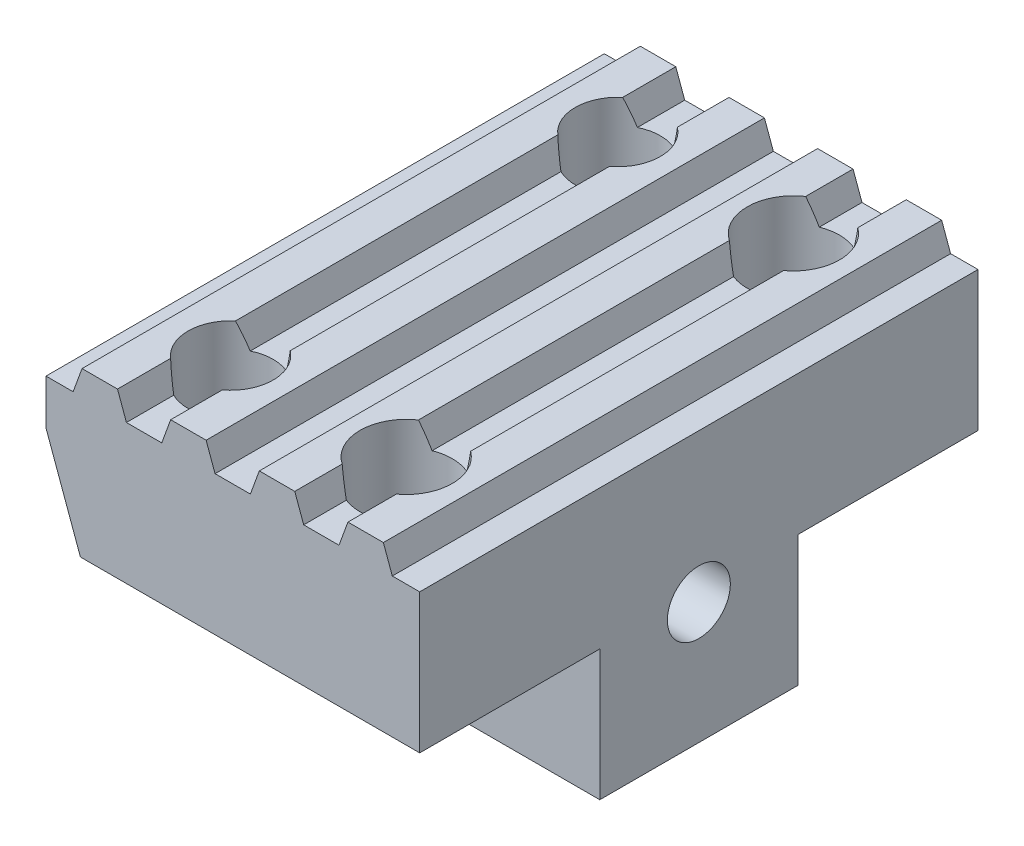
ISO-10303-21;
HEADER;
FILE_DESCRIPTION(('STEP AP214'),'2;1');
FILE_NAME('part.step','',(''),(''),'','','');
FILE_SCHEMA(('AUTOMOTIVE_DESIGN { 1 0 10303 214 1 1 1 1 }'));
ENDSEC;
DATA;
#1=APPLICATION_CONTEXT('core data for automotive mechanical design processes');
#2=APPLICATION_PROTOCOL_DEFINITION('international standard','automotive_design',2000,#1);
#3=PRODUCT_CONTEXT('',#1,'mechanical');
#4=PRODUCT('Part','Part','',(#3));
#5=PRODUCT_RELATED_PRODUCT_CATEGORY('part','',(#4));
#6=PRODUCT_DEFINITION_FORMATION('','',#4);
#7=PRODUCT_DEFINITION_CONTEXT('part definition',#1,'design');
#8=PRODUCT_DEFINITION('design','',#6,#7);
#9=PRODUCT_DEFINITION_SHAPE('','',#8);
#10=(LENGTH_UNIT() NAMED_UNIT(*) SI_UNIT(.MILLI.,.METRE.));
#11=(NAMED_UNIT(*) PLANE_ANGLE_UNIT() SI_UNIT($,.RADIAN.));
#12=(NAMED_UNIT(*) SI_UNIT($,.STERADIAN.) SOLID_ANGLE_UNIT());
#13=UNCERTAINTY_MEASURE_WITH_UNIT(LENGTH_MEASURE(1.E-05),#10,'distance_accuracy_value','');
#14=(GEOMETRIC_REPRESENTATION_CONTEXT(3) GLOBAL_UNCERTAINTY_ASSIGNED_CONTEXT((#13)) GLOBAL_UNIT_ASSIGNED_CONTEXT((#10,
#11,#12)) REPRESENTATION_CONTEXT('',''));
#15=CARTESIAN_POINT('',(0.,0.,0.));
#16=DIRECTION('',(0.,0.,1.));
#17=DIRECTION('',(1.,0.,0.));
#18=AXIS2_PLACEMENT_3D('',#15,#16,#17);
#19=CARTESIAN_POINT('',(7.0167368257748,0.691967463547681,15.748));
#20=DIRECTION('',(-0.939692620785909,-0.342020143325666,0.));
#21=DIRECTION('',(0.342020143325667,-0.939692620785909,0.));
#22=AXIS2_PLACEMENT_3D('',#19,#20,#21);
#23=PLANE('',#22);
#24=DIRECTION('',(0.,0.,0.999999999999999));
#25=VECTOR('',#24,1.);
#26=CARTESIAN_POINT('',(7.26859238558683,0.,15.748));
#27=LINE('',#26,#25);
#28=CARTESIAN_POINT('',(7.26859238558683,0.,14.543770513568));
#29=VERTEX_POINT('',#28);
#30=CARTESIAN_POINT('',(7.26859238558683,0.,15.748));
#31=VERTEX_POINT('',#30);
#32=EDGE_CURVE('E370',#29,#31,#27,.T.);
#33=ORIENTED_EDGE('',*,*,#32,.F.);
#34=CARTESIAN_POINT('',(7.747,-1.31441411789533,13.335));
#35=DIRECTION('',(-0.939692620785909,-0.342020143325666,0.));
#36=DIRECTION('',(0.342020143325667,-0.939692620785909,0.));
#37=AXIS2_PLACEMENT_3D('',#34,#35,#36);
#38=ELLIPSE('',#37,3.80094572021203,1.3);
#39=CARTESIAN_POINT('',(7.0167368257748,0.691967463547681,14.4105071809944));
#40=VERTEX_POINT('',#39);
#41=EDGE_CURVE('E322',#29,#40,#38,.T.);
#42=ORIENTED_EDGE('',*,*,#41,.T.);
#43=DIRECTION('',(0.,0.,-0.999999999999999));
#44=VECTOR('',#43,1.);
#45=CARTESIAN_POINT('',(7.0167368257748,0.691967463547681,15.748));
#46=LINE('',#45,#44);
#47=CARTESIAN_POINT('',(7.0167368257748,0.691967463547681,15.748));
#48=VERTEX_POINT('',#47);
#49=EDGE_CURVE('E363',#48,#40,#46,.T.);
#50=ORIENTED_EDGE('',*,*,#49,.F.);
#51=DIRECTION('',(-0.342020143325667,0.939692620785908,0.));
#52=VECTOR('',#51,1.);
#53=CARTESIAN_POINT('',(7.0167368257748,0.691967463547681,15.748));
#54=LINE('',#53,#52);
#55=EDGE_CURVE('E352',#31,#48,#54,.T.);
#56=ORIENTED_EDGE('',*,*,#55,.F.);
#57=EDGE_LOOP('',(#33,#42,#50,#56));
#58=FACE_BOUND('',#57,.T.);
#59=ADVANCED_FACE('F34',(#58),#23,.F.);
#60=CARTESIAN_POINT('',(0.,0.,15.748));
#61=DIRECTION('',(0.,0.999999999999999,0.));
#62=DIRECTION('',(0.,0.,0.999999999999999));
#63=AXIS2_PLACEMENT_3D('',#60,#61,#62);
#64=PLANE('',#63);
#65=CARTESIAN_POINT('',(7.747,0.,13.335));
#66=DIRECTION('',(0.,0.999999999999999,0.));
#67=DIRECTION('',(0.,0.,0.999999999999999));
#68=AXIS2_PLACEMENT_3D('',#65,#66,#67);
#69=CIRCLE('',#68,1.3);
#70=CARTESIAN_POINT('',(8.26488126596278,0.,12.1426078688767));
#71=VERTEX_POINT('',#70);
#72=CARTESIAN_POINT('',(7.26859238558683,0.,12.126229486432));
#73=VERTEX_POINT('',#72);
#74=EDGE_CURVE('E321',#71,#73,#69,.T.);
#75=ORIENTED_EDGE('',*,*,#74,.F.);
#76=DIRECTION('',(0.,0.,-0.999999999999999));
#77=VECTOR('',#76,1.);
#78=CARTESIAN_POINT('',(8.26488126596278,0.,15.748));
#79=LINE('',#78,#77);
#80=CARTESIAN_POINT('',(8.26488126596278,0.,3.60539213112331));
#81=VERTEX_POINT('',#80);
#82=EDGE_CURVE('E320',#71,#81,#79,.T.);
#83=ORIENTED_EDGE('',*,*,#82,.T.);
#84=CARTESIAN_POINT('',(7.747,0.,2.413));
#85=DIRECTION('',(0.,0.999999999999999,0.));
#86=DIRECTION('',(0.,0.,0.999999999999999));
#87=AXIS2_PLACEMENT_3D('',#84,#85,#86);
#88=CIRCLE('',#87,1.3);
#89=CARTESIAN_POINT('',(7.26859238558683,0.,3.62177051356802));
#90=VERTEX_POINT('',#89);
#91=EDGE_CURVE('E615',#90,#81,#88,.T.);
#92=ORIENTED_EDGE('',*,*,#91,.F.);
#93=EDGE_CURVE('E375',#90,#73,#27,.T.);
#94=ORIENTED_EDGE('',*,*,#93,.T.);
#95=EDGE_LOOP('',(#75,#83,#92,#94));
#96=FACE_BOUND('',#95,.T.);
#97=ADVANCED_FACE('F660',(#96),#64,.T.);
#98=CARTESIAN_POINT('',(8.26195766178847,-0.00803253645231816,15.748));
#99=DIRECTION('',(0.93969262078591,-0.342020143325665,0.));
#100=DIRECTION('',(0.342020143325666,0.939692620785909,0.));
#101=AXIS2_PLACEMENT_3D('',#98,#99,#100);
#102=PLANE('',#101);
#103=ORIENTED_EDGE('',*,*,#82,.F.);
#104=CARTESIAN_POINT('',(7.747,-1.42286708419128,13.335));
#105=DIRECTION('',(0.93969262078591,-0.342020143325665,0.));
#106=DIRECTION('',(-0.342020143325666,-0.939692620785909,0.));
#107=AXIS2_PLACEMENT_3D('',#104,#105,#106);
#108=ELLIPSE('',#107,3.80094572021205,1.3);
#109=CARTESIAN_POINT('',(8.51673682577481,0.691967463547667,12.2873811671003));
#110=VERTEX_POINT('',#109);
#111=EDGE_CURVE('E303',#71,#110,#108,.T.);
#112=ORIENTED_EDGE('',*,*,#111,.T.);
#113=DIRECTION('',(0.,0.,-0.999999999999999));
#114=VECTOR('',#113,1.);
#115=CARTESIAN_POINT('',(8.51673682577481,0.691967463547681,15.748));
#116=LINE('',#115,#114);
#117=CARTESIAN_POINT('',(8.51673682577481,0.691967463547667,3.4606188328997));
#118=VERTEX_POINT('',#117);
#119=EDGE_CURVE('E318',#110,#118,#116,.T.);
#120=ORIENTED_EDGE('',*,*,#119,.T.);
#121=CARTESIAN_POINT('',(7.747,-1.42286708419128,2.413));
#122=DIRECTION('',(0.93969262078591,-0.342020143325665,0.));
#123=DIRECTION('',(-0.342020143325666,-0.939692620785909,0.));
#124=AXIS2_PLACEMENT_3D('',#121,#122,#123);
#125=ELLIPSE('',#124,3.80094572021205,1.3);
#126=EDGE_CURVE('E612',#118,#81,#125,.T.);
#127=ORIENTED_EDGE('',*,*,#126,.T.);
#128=EDGE_LOOP('',(#103,#112,#120,#127));
#129=FACE_BOUND('',#128,.T.);
#130=ADVANCED_FACE('F316',(#129),#102,.F.);
#131=CARTESIAN_POINT('',(8.26488126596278,0.,1.22060786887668));
#132=VERTEX_POINT('',#131);
#133=CARTESIAN_POINT('',(7.26859238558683,0.,1.20422948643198));
#134=VERTEX_POINT('',#133);
#135=EDGE_CURVE('E609',#132,#134,#88,.T.);
#136=ORIENTED_EDGE('',*,*,#135,.F.);
#137=CARTESIAN_POINT('',(8.26488126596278,0.,0.));
#138=VERTEX_POINT('',#137);
#139=EDGE_CURVE('E338',#132,#138,#79,.T.);
#140=ORIENTED_EDGE('',*,*,#139,.T.);
#141=DIRECTION('',(-1.,0.,0.));
#142=VECTOR('',#141,1.);
#143=CARTESIAN_POINT('',(0.,0.,0.));
#144=LINE('',#143,#142);
#145=CARTESIAN_POINT('',(7.26859238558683,0.,0.));
#146=VERTEX_POINT('',#145);
#147=EDGE_CURVE('E412',#138,#146,#144,.T.);
#148=ORIENTED_EDGE('',*,*,#147,.T.);
#149=EDGE_CURVE('E371',#146,#134,#27,.T.);
#150=ORIENTED_EDGE('',*,*,#149,.T.);
#151=EDGE_LOOP('',(#136,#140,#148,#150));
#152=FACE_BOUND('',#151,.T.);
#153=ADVANCED_FACE('F670',(#152),#64,.T.);
#154=CARTESIAN_POINT('',(7.0167368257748,0.691967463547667,12.2594928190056));
#155=VERTEX_POINT('',#154);
#156=CARTESIAN_POINT('',(7.0167368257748,0.691967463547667,3.4885071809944));
#157=VERTEX_POINT('',#156);
#158=EDGE_CURVE('E367',#155,#157,#46,.T.);
#159=ORIENTED_EDGE('',*,*,#158,.F.);
#160=EDGE_CURVE('E629',#155,#73,#38,.T.);
#161=ORIENTED_EDGE('',*,*,#160,.T.);
#162=ORIENTED_EDGE('',*,*,#93,.F.);
#163=CARTESIAN_POINT('',(7.747,-1.31441411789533,2.413));
#164=DIRECTION('',(-0.939692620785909,-0.342020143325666,0.));
#165=DIRECTION('',(0.342020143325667,-0.939692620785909,0.));
#166=AXIS2_PLACEMENT_3D('',#163,#164,#165);
#167=ELLIPSE('',#166,3.80094572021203,1.3);
#168=EDGE_CURVE('E610',#90,#157,#167,.T.);
#169=ORIENTED_EDGE('',*,*,#168,.T.);
#170=EDGE_LOOP('',(#159,#161,#162,#169));
#171=FACE_BOUND('',#170,.T.);
#172=ADVANCED_FACE('F663',(#171),#23,.F.);
#173=ORIENTED_EDGE('',*,*,#139,.F.);
#174=CARTESIAN_POINT('',(8.51673682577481,0.691967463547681,1.3653811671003));
#175=VERTEX_POINT('',#174);
#176=EDGE_CURVE('E606',#132,#175,#125,.T.);
#177=ORIENTED_EDGE('',*,*,#176,.T.);
#178=CARTESIAN_POINT('',(8.51673682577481,0.691967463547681,0.));
#179=VERTEX_POINT('',#178);
#180=EDGE_CURVE('E329',#175,#179,#116,.T.);
#181=ORIENTED_EDGE('',*,*,#180,.T.);
#182=DIRECTION('',(-0.342020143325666,-0.939692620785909,0.));
#183=VECTOR('',#182,1.);
#184=CARTESIAN_POINT('',(8.26195766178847,-0.00803253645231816,0.));
#185=LINE('',#184,#183);
#186=EDGE_CURVE('E552',#179,#138,#185,.T.);
#187=ORIENTED_EDGE('',*,*,#186,.T.);
#188=EDGE_LOOP('',(#173,#177,#181,#187));
#189=FACE_BOUND('',#188,.T.);
#190=ADVANCED_FACE('F604',(#189),#102,.F.);
#191=CARTESIAN_POINT('',(0.761957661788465,-0.00803253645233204,0.));
#192=DIRECTION('',(0.,0.,0.999999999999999));
#193=DIRECTION('',(1.,0.,0.));
#194=AXIS2_PLACEMENT_3D('',#191,#192,#193);
#195=PLANE('',#194);
#196=DIRECTION('',(1.,0.,0.));
#197=VECTOR('',#196,1.);
#198=CARTESIAN_POINT('',(0.,-3.93485799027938,0.));
#199=LINE('',#198,#197);
#200=CARTESIAN_POINT('',(0.969928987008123,-3.93485799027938,0.));
#201=VERTEX_POINT('',#200);
#202=CARTESIAN_POINT('',(10.541,-3.93485799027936,0.));
#203=VERTEX_POINT('',#202);
#204=EDGE_CURVE('E492',#201,#203,#199,.T.);
#205=ORIENTED_EDGE('',*,*,#204,.F.);
#206=DIRECTION('',(0.342020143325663,-0.93969262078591,0.));
#207=VECTOR('',#206,1.);
#208=CARTESIAN_POINT('',(0.,-1.27,0.));
#209=LINE('',#208,#207);
#210=CARTESIAN_POINT('',(0.,-1.27,0.));
#211=VERTEX_POINT('',#210);
#212=EDGE_CURVE('E539',#211,#201,#209,.T.);
#213=ORIENTED_EDGE('',*,*,#212,.F.);
#214=DIRECTION('',(0.,0.999999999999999,0.));
#215=VECTOR('',#214,1.);
#216=CARTESIAN_POINT('',(0.,-7.62,0.));
#217=LINE('',#216,#215);
#218=CARTESIAN_POINT('',(0.,0.,0.));
#219=VERTEX_POINT('',#218);
#220=EDGE_CURVE('E416',#211,#219,#217,.T.);
#221=ORIENTED_EDGE('',*,*,#220,.T.);
#222=CARTESIAN_POINT('',(0.764881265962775,0.,0.));
#223=VERTEX_POINT('',#222);
#224=EDGE_CURVE('E408',#223,#219,#144,.T.);
#225=ORIENTED_EDGE('',*,*,#224,.F.);
#226=DIRECTION('',(-0.342020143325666,-0.939692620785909,0.));
#227=VECTOR('',#226,1.);
#228=CARTESIAN_POINT('',(0.761957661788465,-0.00803253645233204,0.));
#229=LINE('',#228,#227);
#230=CARTESIAN_POINT('',(1.0167368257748,0.691967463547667,0.));
#231=VERTEX_POINT('',#230);
#232=EDGE_CURVE('E436',#231,#223,#229,.T.);
#233=ORIENTED_EDGE('',*,*,#232,.F.);
#234=DIRECTION('',(-1.,0.,0.));
#235=VECTOR('',#234,1.);
#236=CARTESIAN_POINT('',(1.0167368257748,0.691967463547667,0.));
#237=LINE('',#236,#235);
#238=CARTESIAN_POINT('',(2.0167368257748,0.691967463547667,0.));
#239=VERTEX_POINT('',#238);
#240=EDGE_CURVE('E434',#239,#231,#237,.T.);
#241=ORIENTED_EDGE('',*,*,#240,.F.);
#242=DIRECTION('',(-0.342020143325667,0.939692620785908,0.));
#243=VECTOR('',#242,1.);
#244=CARTESIAN_POINT('',(2.0167368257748,0.691967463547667,0.));
#245=LINE('',#244,#243);
#246=CARTESIAN_POINT('',(2.26859238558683,0.,0.));
#247=VERTEX_POINT('',#246);
#248=EDGE_CURVE('E430',#247,#239,#245,.T.);
#249=ORIENTED_EDGE('',*,*,#248,.F.);
#250=CARTESIAN_POINT('',(3.26488126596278,0.,0.));
#251=VERTEX_POINT('',#250);
#252=EDGE_CURVE('E750',#251,#247,#144,.T.);
#253=ORIENTED_EDGE('',*,*,#252,.F.);
#254=DIRECTION('',(-0.342020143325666,-0.939692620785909,0.));
#255=VECTOR('',#254,1.);
#256=CARTESIAN_POINT('',(3.26195766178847,-0.00803253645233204,0.));
#257=LINE('',#256,#255);
#258=CARTESIAN_POINT('',(3.5167368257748,0.691967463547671,0.));
#259=VERTEX_POINT('',#258);
#260=EDGE_CURVE('E380',#259,#251,#257,.T.);
#261=ORIENTED_EDGE('',*,*,#260,.F.);
#262=DIRECTION('',(-1.,0.,0.));
#263=VECTOR('',#262,1.);
#264=CARTESIAN_POINT('',(3.5167368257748,0.691967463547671,0.));
#265=LINE('',#264,#263);
#266=CARTESIAN_POINT('',(4.5167368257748,0.691967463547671,0.));
#267=VERTEX_POINT('',#266);
#268=EDGE_CURVE('E377',#267,#259,#265,.T.);
#269=ORIENTED_EDGE('',*,*,#268,.F.);
#270=DIRECTION('',(-0.342020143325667,0.939692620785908,0.));
#271=VECTOR('',#270,1.);
#272=CARTESIAN_POINT('',(4.5167368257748,0.691967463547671,0.));
#273=LINE('',#272,#271);
#274=CARTESIAN_POINT('',(4.76859238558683,0.,0.));
#275=VERTEX_POINT('',#274);
#276=EDGE_CURVE('E374',#275,#267,#273,.T.);
#277=ORIENTED_EDGE('',*,*,#276,.F.);
#278=CARTESIAN_POINT('',(5.76488126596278,0.,0.));
#279=VERTEX_POINT('',#278);
#280=EDGE_CURVE('E752',#279,#275,#144,.T.);
#281=ORIENTED_EDGE('',*,*,#280,.F.);
#282=DIRECTION('',(-0.342020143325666,-0.939692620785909,0.));
#283=VECTOR('',#282,1.);
#284=CARTESIAN_POINT('',(5.76195766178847,-0.00803253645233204,0.));
#285=LINE('',#284,#283);
#286=CARTESIAN_POINT('',(6.0167368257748,0.691967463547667,0.));
#287=VERTEX_POINT('',#286);
#288=EDGE_CURVE('E349',#287,#279,#285,.T.);
#289=ORIENTED_EDGE('',*,*,#288,.F.);
#290=DIRECTION('',(-1.,0.,0.));
#291=VECTOR('',#290,1.);
#292=CARTESIAN_POINT('',(6.0167368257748,0.691967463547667,0.));
#293=LINE('',#292,#291);
#294=CARTESIAN_POINT('',(7.0167368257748,0.691967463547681,0.));
#295=VERTEX_POINT('',#294);
#296=EDGE_CURVE('E347',#295,#287,#293,.T.);
#297=ORIENTED_EDGE('',*,*,#296,.F.);
#298=DIRECTION('',(-0.342020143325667,0.939692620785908,0.));
#299=VECTOR('',#298,1.);
#300=CARTESIAN_POINT('',(7.0167368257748,0.691967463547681,0.));
#301=LINE('',#300,#299);
#302=EDGE_CURVE('E344',#146,#295,#301,.T.);
#303=ORIENTED_EDGE('',*,*,#302,.F.);
#304=ORIENTED_EDGE('',*,*,#147,.F.);
#305=ORIENTED_EDGE('',*,*,#186,.F.);
#306=DIRECTION('',(-1.,0.,0.));
#307=VECTOR('',#306,1.);
#308=CARTESIAN_POINT('',(8.51673682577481,0.691967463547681,0.));
#309=LINE('',#308,#307);
#310=CARTESIAN_POINT('',(9.51673682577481,0.691967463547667,0.));
#311=VERTEX_POINT('',#310);
#312=EDGE_CURVE('E549',#311,#179,#309,.T.);
#313=ORIENTED_EDGE('',*,*,#312,.F.);
#314=DIRECTION('',(-0.342020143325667,0.939692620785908,0.));
#315=VECTOR('',#314,1.);
#316=CARTESIAN_POINT('',(9.51673682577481,0.691967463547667,0.));
#317=LINE('',#316,#315);
#318=CARTESIAN_POINT('',(9.76859238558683,0.,0.));
#319=VERTEX_POINT('',#318);
#320=EDGE_CURVE('E547',#319,#311,#317,.T.);
#321=ORIENTED_EDGE('',*,*,#320,.F.);
#322=CARTESIAN_POINT('',(10.541,0.,0.));
#323=VERTEX_POINT('',#322);
#324=EDGE_CURVE('E409',#323,#319,#144,.T.);
#325=ORIENTED_EDGE('',*,*,#324,.F.);
#326=DIRECTION('',(0.,0.999999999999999,0.));
#327=VECTOR('',#326,1.);
#328=CARTESIAN_POINT('',(10.541,-7.61999999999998,0.));
#329=LINE('',#328,#327);
#330=EDGE_CURVE('E419',#203,#323,#329,.T.);
#331=ORIENTED_EDGE('',*,*,#330,.F.);
#332=EDGE_LOOP('',(#205,#213,#221,#225,#233,#241,#249,#253,#261,#269,#277,#281,#289,#297,#303,
#304,#305,#313,#321,#325,#331));
#333=FACE_BOUND('',#332,.T.);
#334=ADVANCED_FACE('F592',(#333),#195,.F.);
#335=CARTESIAN_POINT('',(10.541,-7.61999999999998,0.));
#336=DIRECTION('',(1.,0.,0.));
#337=DIRECTION('',(0.,0.,-0.999999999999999));
#338=AXIS2_PLACEMENT_3D('',#335,#336,#337);
#339=PLANE('',#338);
#340=CARTESIAN_POINT('',(10.541,-4.18885799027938,7.87400000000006));
#341=DIRECTION('',(1.,0.,0.));
#342=DIRECTION('',(0.,0.,-0.999999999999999));
#343=AXIS2_PLACEMENT_3D('',#340,#341,#342);
#344=CIRCLE('',#343,0.888999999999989);
#345=CARTESIAN_POINT('',(10.541,-4.18885799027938,6.98500000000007));
#346=VERTEX_POINT('',#345);
#347=EDGE_CURVE('E633',#346,#346,#344,.T.);
#348=ORIENTED_EDGE('',*,*,#347,.F.);
#349=EDGE_LOOP('',(#348));
#350=FACE_BOUND('',#349,.T.);
#351=DIRECTION('',(0.,0.,-0.999999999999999));
#352=VECTOR('',#351,1.);
#353=CARTESIAN_POINT('',(10.541,-7.61999999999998,0.));
#354=LINE('',#353,#352);
#355=CARTESIAN_POINT('',(10.541,-7.61999999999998,10.668));
#356=VERTEX_POINT('',#355);
#357=CARTESIAN_POINT('',(10.541,-7.61999999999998,5.08));
#358=VERTEX_POINT('',#357);
#359=EDGE_CURVE('E411',#356,#358,#354,.T.);
#360=ORIENTED_EDGE('',*,*,#359,.T.);
#361=DIRECTION('',(0.,0.999999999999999,0.));
#362=VECTOR('',#361,1.);
#363=CARTESIAN_POINT('',(10.541,-3.93485799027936,5.07999999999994));
#364=LINE('',#363,#362);
#365=CARTESIAN_POINT('',(10.541,-3.93485799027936,5.07999999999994));
#366=VERTEX_POINT('',#365);
#367=EDGE_CURVE('E489',#358,#366,#364,.T.);
#368=ORIENTED_EDGE('',*,*,#367,.T.);
#369=DIRECTION('',(0.,0.,-0.999999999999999));
#370=VECTOR('',#369,1.);
#371=CARTESIAN_POINT('',(10.541,-3.93485799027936,0.));
#372=LINE('',#371,#370);
#373=EDGE_CURVE('E589',#366,#203,#372,.T.);
#374=ORIENTED_EDGE('',*,*,#373,.T.);
#375=ORIENTED_EDGE('',*,*,#330,.T.);
#376=DIRECTION('',(0.,0.,-0.999999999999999));
#377=VECTOR('',#376,1.);
#378=CARTESIAN_POINT('',(10.541,0.,0.));
#379=LINE('',#378,#377);
#380=CARTESIAN_POINT('',(10.541,0.,15.748));
#381=VERTEX_POINT('',#380);
#382=EDGE_CURVE('E404',#381,#323,#379,.T.);
#383=ORIENTED_EDGE('',*,*,#382,.F.);
#384=DIRECTION('',(0.,0.999999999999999,0.));
#385=VECTOR('',#384,1.);
#386=CARTESIAN_POINT('',(10.541,-7.61999999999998,15.748));
#387=LINE('',#386,#385);
#388=CARTESIAN_POINT('',(10.541,-3.93485799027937,15.748));
#389=VERTEX_POINT('',#388);
#390=EDGE_CURVE('E421',#389,#381,#387,.T.);
#391=ORIENTED_EDGE('',*,*,#390,.F.);
#392=DIRECTION('',(0.,0.,0.999999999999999));
#393=VECTOR('',#392,1.);
#394=CARTESIAN_POINT('',(10.541,-3.93485799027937,15.748));
#395=LINE('',#394,#393);
#396=CARTESIAN_POINT('',(10.541,-3.93485799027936,10.6680000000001));
#397=VERTEX_POINT('',#396);
#398=EDGE_CURVE('E502',#397,#389,#395,.T.);
#399=ORIENTED_EDGE('',*,*,#398,.F.);
#400=DIRECTION('',(0.,0.999999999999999,0.));
#401=VECTOR('',#400,1.);
#402=CARTESIAN_POINT('',(10.541,-3.93485799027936,10.6680000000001));
#403=LINE('',#402,#401);
#404=EDGE_CURVE('E499',#356,#397,#403,.T.);
#405=ORIENTED_EDGE('',*,*,#404,.F.);
#406=EDGE_LOOP('',(#360,#368,#374,#375,#383,#391,#399,#405));
#407=FACE_BOUND('',#406,.T.);
#408=ADVANCED_FACE('F584',(#350,#407),#339,.T.);
#409=CARTESIAN_POINT('',(0.,-7.61999999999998,15.748));
#410=DIRECTION('',(0.,0.999999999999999,0.));
#411=DIRECTION('',(0.,0.,0.999999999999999));
#412=AXIS2_PLACEMENT_3D('',#409,#410,#411);
#413=PLANE('',#412);
#414=DIRECTION('',(1.,0.,0.));
#415=VECTOR('',#414,1.);
#416=CARTESIAN_POINT('',(0.,-7.61999999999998,10.668));
#417=LINE('',#416,#415);
#418=CARTESIAN_POINT('',(3.20047456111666,-7.61999999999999,10.668));
#419=VERTEX_POINT('',#418);
#420=EDGE_CURVE('E484',#419,#356,#417,.T.);
#421=ORIENTED_EDGE('',*,*,#420,.F.);
#422=DIRECTION('',(0.,0.,-0.999999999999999));
#423=VECTOR('',#422,1.);
#424=CARTESIAN_POINT('',(3.20047456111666,-7.62,15.748));
#425=LINE('',#424,#423);
#426=CARTESIAN_POINT('',(3.20047456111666,-7.62,5.07999999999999));
#427=VERTEX_POINT('',#426);
#428=EDGE_CURVE('E475',#419,#427,#425,.T.);
#429=ORIENTED_EDGE('',*,*,#428,.T.);
#430=DIRECTION('',(1.,0.,0.));
#431=VECTOR('',#430,1.);
#432=CARTESIAN_POINT('',(0.,-7.62,5.07999999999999));
#433=LINE('',#432,#431);
#434=EDGE_CURVE('E473',#427,#358,#433,.T.);
#435=ORIENTED_EDGE('',*,*,#434,.T.);
#436=ORIENTED_EDGE('',*,*,#359,.F.);
#437=EDGE_LOOP('',(#421,#429,#435,#436));
#438=FACE_BOUND('',#437,.T.);
#439=ADVANCED_FACE('F481',(#438),#413,.F.);
#440=CARTESIAN_POINT('',(0.,-1.26999999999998,15.748));
#441=DIRECTION('',(0.939692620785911,0.342020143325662,0.));
#442=DIRECTION('',(-0.342020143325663,0.93969262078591,0.));
#443=AXIS2_PLACEMENT_3D('',#440,#441,#442);
#444=PLANE('',#443);
#445=DIRECTION('',(-0.342020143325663,0.93969262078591,0.));
#446=VECTOR('',#445,1.);
#447=CARTESIAN_POINT('',(0.,-1.27000000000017,5.07999999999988));
#448=LINE('',#447,#446);
#449=CARTESIAN_POINT('',(2.00706493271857,-6.78436558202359,5.07999999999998));
#450=VERTEX_POINT('',#449);
#451=CARTESIAN_POINT('',(0.969928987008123,-3.93485799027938,5.07999999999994));
#452=VERTEX_POINT('',#451);
#453=EDGE_CURVE('E468',#450,#452,#448,.T.);
#454=ORIENTED_EDGE('',*,*,#453,.F.);
#455=DIRECTION('',(0.,0.,-0.999999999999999));
#456=VECTOR('',#455,1.);
#457=CARTESIAN_POINT('',(2.00706493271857,-6.78436558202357,15.748));
#458=LINE('',#457,#456);
#459=CARTESIAN_POINT('',(2.00706493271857,-6.78436558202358,10.668));
#460=VERTEX_POINT('',#459);
#461=EDGE_CURVE('E42',#450,#460,#458,.F.);
#462=ORIENTED_EDGE('',*,*,#461,.T.);
#463=DIRECTION('',(-0.342020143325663,0.93969262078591,0.));
#464=VECTOR('',#463,1.);
#465=CARTESIAN_POINT('',(0.,-1.26999999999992,10.6680000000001));
#466=LINE('',#465,#464);
#467=CARTESIAN_POINT('',(0.969928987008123,-3.93485799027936,10.6680000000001));
#468=VERTEX_POINT('',#467);
#469=EDGE_CURVE('E461',#460,#468,#466,.T.);
#470=ORIENTED_EDGE('',*,*,#469,.T.);
#471=DIRECTION('',(0.,0.,0.999999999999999));
#472=VECTOR('',#471,1.);
#473=CARTESIAN_POINT('',(0.969928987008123,-3.93485799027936,15.748));
#474=LINE('',#473,#472);
#475=CARTESIAN_POINT('',(0.969928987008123,-3.93485799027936,15.748));
#476=VERTEX_POINT('',#475);
#477=EDGE_CURVE('E465',#468,#476,#474,.T.);
#478=ORIENTED_EDGE('',*,*,#477,.T.);
#479=DIRECTION('',(0.342020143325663,-0.93969262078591,0.));
#480=VECTOR('',#479,1.);
#481=CARTESIAN_POINT('',(0.,-1.26999999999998,15.748));
#482=LINE('',#481,#480);
#483=CARTESIAN_POINT('',(0.,-1.26999999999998,15.748));
#484=VERTEX_POINT('',#483);
#485=EDGE_CURVE('E542',#484,#476,#482,.T.);
#486=ORIENTED_EDGE('',*,*,#485,.F.);
#487=DIRECTION('',(0.,0.,-0.999999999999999));
#488=VECTOR('',#487,1.);
#489=CARTESIAN_POINT('',(0.,-1.26999999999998,15.748));
#490=LINE('',#489,#488);
#491=EDGE_CURVE('E545',#484,#211,#490,.T.);
#492=ORIENTED_EDGE('',*,*,#491,.T.);
#493=ORIENTED_EDGE('',*,*,#212,.T.);
#494=DIRECTION('',(0.,0.,-0.999999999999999));
#495=VECTOR('',#494,1.);
#496=CARTESIAN_POINT('',(0.969928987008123,-3.93485799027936,15.748));
#497=LINE('',#496,#495);
#498=EDGE_CURVE('E472',#452,#201,#497,.T.);
#499=ORIENTED_EDGE('',*,*,#498,.F.);
#500=EDGE_LOOP('',(#454,#462,#470,#478,#486,#492,#493,#499));
#501=FACE_BOUND('',#500,.T.);
#502=ADVANCED_FACE('F655',(#501),#444,.F.);
#503=CARTESIAN_POINT('',(2.79399999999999,0.691967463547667,2.413));
#504=DIRECTION('',(0.,0.999999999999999,0.));
#505=DIRECTION('',(0.,0.,0.999999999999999));
#506=AXIS2_PLACEMENT_3D('',#503,#504,#505);
#507=CYLINDRICAL_SURFACE('',#506,1.20015);
#508=CARTESIAN_POINT('',(2.79399999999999,0.,2.413));
#509=DIRECTION('',(0.,0.999999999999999,0.));
#510=DIRECTION('',(0.,0.,0.999999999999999));
#511=AXIS2_PLACEMENT_3D('',#508,#509,#510);
#512=CIRCLE('',#511,1.20015);
#513=CARTESIAN_POINT('',(2.26859238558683,0.,3.49203051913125));
#514=VERTEX_POINT('',#513);
#515=CARTESIAN_POINT('',(3.26488126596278,0.,3.51691614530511));
#516=VERTEX_POINT('',#515);
#517=EDGE_CURVE('E535',#514,#516,#512,.T.);
#518=ORIENTED_EDGE('',*,*,#517,.T.);
#519=CARTESIAN_POINT('',(2.79399999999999,-1.29373564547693,2.413));
#520=DIRECTION('',(0.93969262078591,-0.342020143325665,0.));
#521=DIRECTION('',(0.342020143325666,0.939692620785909,0.));
#522=AXIS2_PLACEMENT_3D('',#519,#520,#521);
#523=ELLIPSE('',#522,3.50900385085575,1.20015);
#524=CARTESIAN_POINT('',(3.5167368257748,0.691967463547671,3.37112916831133));
#525=VERTEX_POINT('',#524);
#526=EDGE_CURVE('E532',#525,#516,#523,.T.);
#527=ORIENTED_EDGE('',*,*,#526,.F.);
#528=CARTESIAN_POINT('',(2.79399999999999,0.691967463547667,2.413));
#529=DIRECTION('',(0.,0.999999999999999,0.));
#530=DIRECTION('',(0.,0.,0.999999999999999));
#531=AXIS2_PLACEMENT_3D('',#528,#529,#530);
#532=CIRCLE('',#531,1.20015);
#533=CARTESIAN_POINT('',(3.5167368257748,0.691967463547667,1.45487083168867));
#534=VERTEX_POINT('',#533);
#535=EDGE_CURVE('E525',#525,#534,#532,.T.);
#536=ORIENTED_EDGE('',*,*,#535,.T.);
#537=CARTESIAN_POINT('',(3.26488126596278,0.,1.30908385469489));
#538=VERTEX_POINT('',#537);
#539=EDGE_CURVE('E527',#538,#534,#523,.T.);
#540=ORIENTED_EDGE('',*,*,#539,.F.);
#541=CARTESIAN_POINT('',(2.26859238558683,0.,1.33396948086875));
#542=VERTEX_POINT('',#541);
#543=EDGE_CURVE('E531',#538,#542,#512,.T.);
#544=ORIENTED_EDGE('',*,*,#543,.T.);
#545=CARTESIAN_POINT('',(2.79399999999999,-1.4435455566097,2.413));
#546=DIRECTION('',(-0.939692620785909,-0.342020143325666,0.));
#547=DIRECTION('',(-0.342020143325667,0.939692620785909,0.));
#548=AXIS2_PLACEMENT_3D('',#545,#546,#547);
#549=ELLIPSE('',#548,3.50900385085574,1.20015);
#550=CARTESIAN_POINT('',(2.0167368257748,0.691967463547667,1.49854826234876));
#551=VERTEX_POINT('',#550);
#552=EDGE_CURVE('E534',#551,#542,#549,.T.);
#553=ORIENTED_EDGE('',*,*,#552,.F.);
#554=CARTESIAN_POINT('',(2.0167368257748,0.691967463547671,3.32745173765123));
#555=VERTEX_POINT('',#554);
#556=EDGE_CURVE('E528',#551,#555,#532,.T.);
#557=ORIENTED_EDGE('',*,*,#556,.T.);
#558=EDGE_CURVE('E538',#514,#555,#549,.T.);
#559=ORIENTED_EDGE('',*,*,#558,.F.);
#560=EDGE_LOOP('',(#518,#527,#536,#540,#544,#553,#557,#559));
#561=FACE_BOUND('',#560,.T.);
#562=CARTESIAN_POINT('',(2.79399999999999,-3.93485799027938,2.41300000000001));
#563=DIRECTION('',(0.,-0.999999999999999,0.));
#564=DIRECTION('',(0.,0.,-0.999999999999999));
#565=AXIS2_PLACEMENT_3D('',#562,#563,#564);
#566=CIRCLE('',#565,1.20015);
#567=CARTESIAN_POINT('',(2.79399999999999,-3.93485799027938,1.21285000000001));
#568=VERTEX_POINT('',#567);
#569=EDGE_CURVE('E469',#568,#568,#566,.F.);
#570=ORIENTED_EDGE('',*,*,#569,.F.);
#571=EDGE_LOOP('',(#570));
#572=FACE_BOUND('',#571,.T.);
#573=ADVANCED_FACE('F768',(#561,#572),#507,.F.);
#574=CARTESIAN_POINT('',(3.26195766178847,-0.00803253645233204,15.748));
#575=DIRECTION('',(0.93969262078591,-0.342020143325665,0.));
#576=DIRECTION('',(0.342020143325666,0.939692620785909,0.));
#577=AXIS2_PLACEMENT_3D('',#574,#575,#576);
#578=PLANE('',#577);
#579=DIRECTION('',(0.,0.,-0.999999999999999));
#580=VECTOR('',#579,1.);
#581=CARTESIAN_POINT('',(3.5167368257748,0.691967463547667,15.748));
#582=LINE('',#581,#580);
#583=CARTESIAN_POINT('',(3.5167368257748,0.691967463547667,15.748));
#584=VERTEX_POINT('',#583);
#585=CARTESIAN_POINT('',(3.5167368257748,0.691967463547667,14.2931291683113));
#586=VERTEX_POINT('',#585);
#587=EDGE_CURVE('E391',#584,#586,#582,.T.);
#588=ORIENTED_EDGE('',*,*,#587,.T.);
#589=CARTESIAN_POINT('',(2.79399999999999,-1.29373564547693,13.335));
#590=DIRECTION('',(0.93969262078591,-0.342020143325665,0.));
#591=DIRECTION('',(0.342020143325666,0.939692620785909,0.));
#592=AXIS2_PLACEMENT_3D('',#589,#590,#591);
#593=ELLIPSE('',#592,3.50900385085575,1.20015);
#594=CARTESIAN_POINT('',(3.26488126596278,0.,14.4389161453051));
#595=VERTEX_POINT('',#594);
#596=EDGE_CURVE('E520',#586,#595,#593,.T.);
#597=ORIENTED_EDGE('',*,*,#596,.T.);
#598=DIRECTION('',(0.,0.,-0.999999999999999));
#599=VECTOR('',#598,1.);
#600=CARTESIAN_POINT('',(3.26488126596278,0.,15.748));
#601=LINE('',#600,#599);
#602=CARTESIAN_POINT('',(3.26488126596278,0.,15.748));
#603=VERTEX_POINT('',#602);
#604=EDGE_CURVE('E455',#603,#595,#601,.T.);
#605=ORIENTED_EDGE('',*,*,#604,.F.);
#606=DIRECTION('',(-0.342020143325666,-0.939692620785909,0.));
#607=VECTOR('',#606,1.);
#608=CARTESIAN_POINT('',(3.26195766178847,-0.00803253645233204,15.748));
#609=LINE('',#608,#607);
#610=EDGE_CURVE('E387',#584,#603,#609,.T.);
#611=ORIENTED_EDGE('',*,*,#610,.F.);
#612=EDGE_LOOP('',(#588,#597,#605,#611));
#613=FACE_BOUND('',#612,.T.);
#614=ADVANCED_FACE('F687',(#613),#578,.F.);
#615=CARTESIAN_POINT('',(2.79399999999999,0.,13.335));
#616=DIRECTION('',(0.,0.999999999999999,0.));
#617=DIRECTION('',(0.,0.,0.999999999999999));
#618=AXIS2_PLACEMENT_3D('',#615,#616,#617);
#619=CIRCLE('',#618,1.20015);
#620=CARTESIAN_POINT('',(3.26488126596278,0.,12.2310838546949));
#621=VERTEX_POINT('',#620);
#622=CARTESIAN_POINT('',(2.26859238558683,0.,12.2559694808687));
#623=VERTEX_POINT('',#622);
#624=EDGE_CURVE('E521',#621,#623,#619,.T.);
#625=ORIENTED_EDGE('',*,*,#624,.F.);
#626=EDGE_CURVE('E459',#621,#516,#601,.T.);
#627=ORIENTED_EDGE('',*,*,#626,.T.);
#628=ORIENTED_EDGE('',*,*,#517,.F.);
#629=DIRECTION('',(0.,0.,-0.999999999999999));
#630=VECTOR('',#629,1.);
#631=CARTESIAN_POINT('',(2.26859238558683,0.,15.748));
#632=LINE('',#631,#630);
#633=EDGE_CURVE('E431',#623,#514,#632,.T.);
#634=ORIENTED_EDGE('',*,*,#633,.F.);
#635=EDGE_LOOP('',(#625,#627,#628,#634));
#636=FACE_BOUND('',#635,.T.);
#637=ADVANCED_FACE('F782',(#636),#64,.T.);
#638=CARTESIAN_POINT('',(2.0167368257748,0.691967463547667,15.748));
#639=DIRECTION('',(-0.939692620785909,-0.342020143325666,0.));
#640=DIRECTION('',(0.342020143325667,-0.939692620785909,0.));
#641=AXIS2_PLACEMENT_3D('',#638,#639,#640);
#642=PLANE('',#641);
#643=DIRECTION('',(0.,0.,-0.999999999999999));
#644=VECTOR('',#643,1.);
#645=CARTESIAN_POINT('',(2.0167368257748,0.691967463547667,15.748));
#646=LINE('',#645,#644);
#647=CARTESIAN_POINT('',(2.0167368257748,0.691967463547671,12.4205482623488));
#648=VERTEX_POINT('',#647);
#649=EDGE_CURVE('E454',#648,#555,#646,.T.);
#650=ORIENTED_EDGE('',*,*,#649,.F.);
#651=CARTESIAN_POINT('',(2.79399999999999,-1.4435455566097,13.335));
#652=DIRECTION('',(-0.939692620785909,-0.342020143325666,0.));
#653=DIRECTION('',(-0.342020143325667,0.939692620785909,0.));
#654=AXIS2_PLACEMENT_3D('',#651,#652,#653);
#655=ELLIPSE('',#654,3.50900385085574,1.20015);
#656=EDGE_CURVE('E518',#648,#623,#655,.T.);
#657=ORIENTED_EDGE('',*,*,#656,.T.);
#658=ORIENTED_EDGE('',*,*,#633,.T.);
#659=ORIENTED_EDGE('',*,*,#558,.T.);
#660=EDGE_LOOP('',(#650,#657,#658,#659));
#661=FACE_BOUND('',#660,.T.);
#662=ADVANCED_FACE('F775',(#661),#642,.F.);
#663=ORIENTED_EDGE('',*,*,#543,.F.);
#664=EDGE_CURVE('E453',#538,#251,#601,.T.);
#665=ORIENTED_EDGE('',*,*,#664,.T.);
#666=ORIENTED_EDGE('',*,*,#252,.T.);
#667=EDGE_CURVE('E426',#542,#247,#632,.T.);
#668=ORIENTED_EDGE('',*,*,#667,.F.);
#669=EDGE_LOOP('',(#663,#665,#666,#668));
#670=FACE_BOUND('',#669,.T.);
#671=ADVANCED_FACE('F785',(#670),#64,.T.);
#672=EDGE_CURVE('E449',#551,#239,#646,.T.);
#673=ORIENTED_EDGE('',*,*,#672,.F.);
#674=ORIENTED_EDGE('',*,*,#552,.T.);
#675=ORIENTED_EDGE('',*,*,#667,.T.);
#676=ORIENTED_EDGE('',*,*,#248,.T.);
#677=EDGE_LOOP('',(#673,#674,#675,#676));
#678=FACE_BOUND('',#677,.T.);
#679=ADVANCED_FACE('F788',(#678),#642,.F.);
#680=ORIENTED_EDGE('',*,*,#626,.F.);
#681=CARTESIAN_POINT('',(3.5167368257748,0.691967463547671,12.3768708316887));
#682=VERTEX_POINT('',#681);
#683=EDGE_CURVE('E524',#621,#682,#593,.T.);
#684=ORIENTED_EDGE('',*,*,#683,.T.);
#685=EDGE_CURVE('E395',#682,#525,#582,.T.);
#686=ORIENTED_EDGE('',*,*,#685,.T.);
#687=ORIENTED_EDGE('',*,*,#526,.T.);
#688=EDGE_LOOP('',(#680,#684,#686,#687));
#689=FACE_BOUND('',#688,.T.);
#690=ADVANCED_FACE('F688',(#689),#578,.F.);
#691=ORIENTED_EDGE('',*,*,#324,.T.);
#692=DIRECTION('',(0.,0.,0.999999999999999));
#693=VECTOR('',#692,1.);
#694=CARTESIAN_POINT('',(9.76859238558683,0.,15.748));
#695=LINE('',#694,#693);
#696=CARTESIAN_POINT('',(9.76859238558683,0.,15.748));
#697=VERTEX_POINT('',#696);
#698=EDGE_CURVE('E342',#319,#697,#695,.T.);
#699=ORIENTED_EDGE('',*,*,#698,.T.);
#700=DIRECTION('',(1.,0.,0.));
#701=VECTOR('',#700,1.);
#702=CARTESIAN_POINT('',(0.,0.,15.748));
#703=LINE('',#702,#701);
#704=EDGE_CURVE('E401',#697,#381,#703,.T.);
#705=ORIENTED_EDGE('',*,*,#704,.T.);
#706=ORIENTED_EDGE('',*,*,#382,.T.);
#707=EDGE_LOOP('',(#691,#699,#705,#706));
#708=FACE_BOUND('',#707,.T.);
#709=ADVANCED_FACE('F578',(#708),#64,.T.);
#710=CARTESIAN_POINT('',(8.26488126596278,0.,14.5273921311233));
#711=VERTEX_POINT('',#710);
#712=EDGE_CURVE('E571',#29,#711,#69,.T.);
#713=ORIENTED_EDGE('',*,*,#712,.F.);
#714=ORIENTED_EDGE('',*,*,#32,.T.);
#715=CARTESIAN_POINT('',(8.26488126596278,0.,15.748));
#716=VERTEX_POINT('',#715);
#717=EDGE_CURVE('E563',#31,#716,#703,.T.);
#718=ORIENTED_EDGE('',*,*,#717,.T.);
#719=EDGE_CURVE('E339',#716,#711,#79,.T.);
#720=ORIENTED_EDGE('',*,*,#719,.T.);
#721=EDGE_LOOP('',(#713,#714,#718,#720));
#722=FACE_BOUND('',#721,.T.);
#723=ADVANCED_FACE('F570',(#722),#64,.T.);
#724=CARTESIAN_POINT('',(4.76859238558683,0.,15.748));
#725=VERTEX_POINT('',#724);
#726=CARTESIAN_POINT('',(5.76488126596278,0.,15.748));
#727=VERTEX_POINT('',#726);
#728=EDGE_CURVE('E573',#725,#727,#703,.T.);
#729=ORIENTED_EDGE('',*,*,#728,.T.);
#730=DIRECTION('',(0.,0.,-0.999999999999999));
#731=VECTOR('',#730,1.);
#732=CARTESIAN_POINT('',(5.76488126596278,0.,15.748));
#733=LINE('',#732,#731);
#734=EDGE_CURVE('E366',#727,#279,#733,.T.);
#735=ORIENTED_EDGE('',*,*,#734,.T.);
#736=ORIENTED_EDGE('',*,*,#280,.T.);
#737=DIRECTION('',(0.,0.,0.999999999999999));
#738=VECTOR('',#737,1.);
#739=CARTESIAN_POINT('',(4.76859238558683,0.,15.748));
#740=LINE('',#739,#738);
#741=EDGE_CURVE('E458',#275,#725,#740,.T.);
#742=ORIENTED_EDGE('',*,*,#741,.T.);
#743=EDGE_LOOP('',(#729,#735,#736,#742));
#744=FACE_BOUND('',#743,.T.);
#745=ADVANCED_FACE('F757',(#744),#64,.T.);
#746=CARTESIAN_POINT('',(2.26859238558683,0.,14.4140305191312));
#747=VERTEX_POINT('',#746);
#748=EDGE_CURVE('E517',#747,#595,#619,.T.);
#749=ORIENTED_EDGE('',*,*,#748,.F.);
#750=CARTESIAN_POINT('',(2.26859238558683,0.,15.748));
#751=VERTEX_POINT('',#750);
#752=EDGE_CURVE('E427',#751,#747,#632,.T.);
#753=ORIENTED_EDGE('',*,*,#752,.F.);
#754=EDGE_CURVE('E405',#751,#603,#703,.T.);
#755=ORIENTED_EDGE('',*,*,#754,.T.);
#756=ORIENTED_EDGE('',*,*,#604,.T.);
#757=EDGE_LOOP('',(#749,#753,#755,#756));
#758=FACE_BOUND('',#757,.T.);
#759=ADVANCED_FACE('F731',(#758),#64,.T.);
#760=ORIENTED_EDGE('',*,*,#752,.T.);
#761=CARTESIAN_POINT('',(2.0167368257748,0.691967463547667,14.2494517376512));
#762=VERTEX_POINT('',#761);
#763=EDGE_CURVE('E514',#747,#762,#655,.T.);
#764=ORIENTED_EDGE('',*,*,#763,.T.);
#765=CARTESIAN_POINT('',(2.0167368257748,0.691967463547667,15.748));
#766=VERTEX_POINT('',#765);
#767=EDGE_CURVE('E450',#766,#762,#646,.T.);
#768=ORIENTED_EDGE('',*,*,#767,.F.);
#769=DIRECTION('',(-0.342020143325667,0.939692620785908,0.));
#770=VECTOR('',#769,1.);
#771=CARTESIAN_POINT('',(2.0167368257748,0.691967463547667,15.748));
#772=LINE('',#771,#770);
#773=EDGE_CURVE('E439',#751,#766,#772,.T.);
#774=ORIENTED_EDGE('',*,*,#773,.F.);
#775=EDGE_LOOP('',(#760,#764,#768,#774));
#776=FACE_BOUND('',#775,.T.);
#777=ADVANCED_FACE('F36',(#776),#642,.F.);
#778=CARTESIAN_POINT('',(1.0167368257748,0.691967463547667,15.748));
#779=DIRECTION('',(0.,-0.999999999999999,0.));
#780=DIRECTION('',(0.,0.,-0.999999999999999));
#781=AXIS2_PLACEMENT_3D('',#778,#779,#780);
#782=PLANE('',#781);
#783=ORIENTED_EDGE('',*,*,#767,.T.);
#784=CARTESIAN_POINT('',(2.79399999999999,0.691967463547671,13.335));
#785=DIRECTION('',(0.,0.999999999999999,0.));
#786=DIRECTION('',(0.,0.,0.999999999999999));
#787=AXIS2_PLACEMENT_3D('',#784,#785,#786);
#788=CIRCLE('',#787,1.20015);
#789=EDGE_CURVE('E511',#648,#762,#788,.T.);
#790=ORIENTED_EDGE('',*,*,#789,.F.);
#791=ORIENTED_EDGE('',*,*,#649,.T.);
#792=ORIENTED_EDGE('',*,*,#556,.F.);
#793=ORIENTED_EDGE('',*,*,#672,.T.);
#794=ORIENTED_EDGE('',*,*,#240,.T.);
#795=DIRECTION('',(0.,0.,-0.999999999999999));
#796=VECTOR('',#795,1.);
#797=CARTESIAN_POINT('',(1.0167368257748,0.691967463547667,15.748));
#798=LINE('',#797,#796);
#799=CARTESIAN_POINT('',(1.0167368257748,0.691967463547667,15.748));
#800=VERTEX_POINT('',#799);
#801=EDGE_CURVE('E446',#800,#231,#798,.T.);
#802=ORIENTED_EDGE('',*,*,#801,.F.);
#803=DIRECTION('',(-1.,0.,0.));
#804=VECTOR('',#803,1.);
#805=CARTESIAN_POINT('',(1.0167368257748,0.691967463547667,15.748));
#806=LINE('',#805,#804);
#807=EDGE_CURVE('E441',#766,#800,#806,.T.);
#808=ORIENTED_EDGE('',*,*,#807,.F.);
#809=EDGE_LOOP('',(#783,#790,#791,#792,#793,#794,#802,#808));
#810=FACE_BOUND('',#809,.T.);
#811=ADVANCED_FACE('F739',(#810),#782,.F.);
#812=CARTESIAN_POINT('',(0.761957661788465,-0.00803253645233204,15.748));
#813=DIRECTION('',(0.93969262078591,-0.342020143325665,0.));
#814=DIRECTION('',(0.342020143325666,0.939692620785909,0.));
#815=AXIS2_PLACEMENT_3D('',#812,#813,#814);
#816=PLANE('',#815);
#817=ORIENTED_EDGE('',*,*,#232,.T.);
#818=DIRECTION('',(0.,0.,0.999999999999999));
#819=VECTOR('',#818,1.);
#820=CARTESIAN_POINT('',(0.764881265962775,0.,15.748));
#821=LINE('',#820,#819);
#822=CARTESIAN_POINT('',(0.764881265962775,0.,15.748));
#823=VERTEX_POINT('',#822);
#824=EDGE_CURVE('E418',#223,#823,#821,.T.);
#825=ORIENTED_EDGE('',*,*,#824,.T.);
#826=DIRECTION('',(-0.342020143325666,-0.939692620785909,0.));
#827=VECTOR('',#826,1.);
#828=CARTESIAN_POINT('',(0.761957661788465,-0.00803253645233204,15.748));
#829=LINE('',#828,#827);
#830=EDGE_CURVE('E443',#800,#823,#829,.T.);
#831=ORIENTED_EDGE('',*,*,#830,.F.);
#832=ORIENTED_EDGE('',*,*,#801,.T.);
#833=EDGE_LOOP('',(#817,#825,#831,#832));
#834=FACE_BOUND('',#833,.T.);
#835=ADVANCED_FACE('F743',(#834),#816,.F.);
#836=CARTESIAN_POINT('',(0.761957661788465,-0.00803253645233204,15.748));
#837=DIRECTION('',(0.,0.,0.999999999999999));
#838=DIRECTION('',(1.,0.,0.));
#839=AXIS2_PLACEMENT_3D('',#836,#837,#838);
#840=PLANE('',#839);
#841=DIRECTION('',(1.,0.,0.));
#842=VECTOR('',#841,1.);
#843=CARTESIAN_POINT('',(0.,-3.93485799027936,15.748));
#844=LINE('',#843,#842);
#845=EDGE_CURVE('E466',#476,#389,#844,.T.);
#846=ORIENTED_EDGE('',*,*,#845,.T.);
#847=ORIENTED_EDGE('',*,*,#390,.T.);
#848=ORIENTED_EDGE('',*,*,#704,.F.);
#849=DIRECTION('',(-0.342020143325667,0.939692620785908,0.));
#850=VECTOR('',#849,1.);
#851=CARTESIAN_POINT('',(9.51673682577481,0.691967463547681,15.748));
#852=LINE('',#851,#850);
#853=CARTESIAN_POINT('',(9.51673682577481,0.691967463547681,15.748));
#854=VERTEX_POINT('',#853);
#855=EDGE_CURVE('E555',#697,#854,#852,.T.);
#856=ORIENTED_EDGE('',*,*,#855,.T.);
#857=DIRECTION('',(-1.,0.,0.));
#858=VECTOR('',#857,1.);
#859=CARTESIAN_POINT('',(8.51673682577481,0.691967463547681,15.748));
#860=LINE('',#859,#858);
#861=CARTESIAN_POINT('',(8.51673682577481,0.691967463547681,15.748));
#862=VERTEX_POINT('',#861);
#863=EDGE_CURVE('E556',#854,#862,#860,.T.);
#864=ORIENTED_EDGE('',*,*,#863,.T.);
#865=DIRECTION('',(-0.342020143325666,-0.939692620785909,0.));
#866=VECTOR('',#865,1.);
#867=CARTESIAN_POINT('',(8.26195766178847,-0.00803253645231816,15.748));
#868=LINE('',#867,#866);
#869=EDGE_CURVE('E332',#862,#716,#868,.T.);
#870=ORIENTED_EDGE('',*,*,#869,.T.);
#871=ORIENTED_EDGE('',*,*,#717,.F.);
#872=ORIENTED_EDGE('',*,*,#55,.T.);
#873=DIRECTION('',(-1.,0.,0.));
#874=VECTOR('',#873,1.);
#875=CARTESIAN_POINT('',(6.0167368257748,0.691967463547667,15.748));
#876=LINE('',#875,#874);
#877=CARTESIAN_POINT('',(6.0167368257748,0.691967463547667,15.748));
#878=VERTEX_POINT('',#877);
#879=EDGE_CURVE('E354',#48,#878,#876,.T.);
#880=ORIENTED_EDGE('',*,*,#879,.T.);
#881=DIRECTION('',(-0.342020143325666,-0.939692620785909,0.));
#882=VECTOR('',#881,1.);
#883=CARTESIAN_POINT('',(5.76195766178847,-0.00803253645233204,15.748));
#884=LINE('',#883,#882);
#885=EDGE_CURVE('E356',#878,#727,#884,.T.);
#886=ORIENTED_EDGE('',*,*,#885,.T.);
#887=ORIENTED_EDGE('',*,*,#728,.F.);
#888=DIRECTION('',(-0.342020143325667,0.939692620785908,0.));
#889=VECTOR('',#888,1.);
#890=CARTESIAN_POINT('',(4.5167368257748,0.691967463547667,15.748));
#891=LINE('',#890,#889);
#892=CARTESIAN_POINT('',(4.5167368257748,0.691967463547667,15.748));
#893=VERTEX_POINT('',#892);
#894=EDGE_CURVE('E383',#725,#893,#891,.T.);
#895=ORIENTED_EDGE('',*,*,#894,.T.);
#896=DIRECTION('',(-1.,0.,0.));
#897=VECTOR('',#896,1.);
#898=CARTESIAN_POINT('',(3.5167368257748,0.691967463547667,15.748));
#899=LINE('',#898,#897);
#900=EDGE_CURVE('E385',#893,#584,#899,.T.);
#901=ORIENTED_EDGE('',*,*,#900,.T.);
#902=ORIENTED_EDGE('',*,*,#610,.T.);
#903=ORIENTED_EDGE('',*,*,#754,.F.);
#904=ORIENTED_EDGE('',*,*,#773,.T.);
#905=ORIENTED_EDGE('',*,*,#807,.T.);
#906=ORIENTED_EDGE('',*,*,#830,.T.);
#907=CARTESIAN_POINT('',(0.,0.,15.748));
#908=VERTEX_POINT('',#907);
#909=EDGE_CURVE('E402',#908,#823,#703,.T.);
#910=ORIENTED_EDGE('',*,*,#909,.F.);
#911=DIRECTION('',(0.,0.999999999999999,0.));
#912=VECTOR('',#911,1.);
#913=CARTESIAN_POINT('',(0.,-7.61999999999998,15.748));
#914=LINE('',#913,#912);
#915=EDGE_CURVE('E415',#484,#908,#914,.T.);
#916=ORIENTED_EDGE('',*,*,#915,.F.);
#917=ORIENTED_EDGE('',*,*,#485,.T.);
#918=EDGE_LOOP('',(#846,#847,#848,#856,#864,#870,#871,#872,#880,#886,#887,#895,#901,#902,#903,
#904,#905,#906,#910,#916,#917));
#919=FACE_BOUND('',#918,.T.);
#920=ADVANCED_FACE('F562',(#919),#840,.T.);
#921=ORIENTED_EDGE('',*,*,#824,.F.);
#922=ORIENTED_EDGE('',*,*,#224,.T.);
#923=DIRECTION('',(0.,0.,0.999999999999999));
#924=VECTOR('',#923,1.);
#925=CARTESIAN_POINT('',(0.,0.,0.));
#926=LINE('',#925,#924);
#927=EDGE_CURVE('E398',#219,#908,#926,.T.);
#928=ORIENTED_EDGE('',*,*,#927,.T.);
#929=ORIENTED_EDGE('',*,*,#909,.T.);
#930=EDGE_LOOP('',(#921,#922,#928,#929));
#931=FACE_BOUND('',#930,.T.);
#932=ADVANCED_FACE('F747',(#931),#64,.T.);
#933=CARTESIAN_POINT('',(0.,-7.62,0.));
#934=DIRECTION('',(-1.,0.,0.));
#935=DIRECTION('',(0.,0.,0.999999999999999));
#936=AXIS2_PLACEMENT_3D('',#933,#934,#935);
#937=PLANE('',#936);
#938=ORIENTED_EDGE('',*,*,#491,.F.);
#939=ORIENTED_EDGE('',*,*,#915,.T.);
#940=ORIENTED_EDGE('',*,*,#927,.F.);
#941=ORIENTED_EDGE('',*,*,#220,.F.);
#942=EDGE_LOOP('',(#938,#939,#940,#941));
#943=FACE_BOUND('',#942,.T.);
#944=ADVANCED_FACE('F925',(#943),#937,.T.);
#945=CARTESIAN_POINT('',(4.5167368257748,0.691967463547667,15.748));
#946=DIRECTION('',(-0.939692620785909,-0.342020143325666,0.));
#947=DIRECTION('',(0.342020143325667,-0.939692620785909,0.));
#948=AXIS2_PLACEMENT_3D('',#945,#946,#947);
#949=PLANE('',#948);
#950=ORIENTED_EDGE('',*,*,#741,.F.);
#951=ORIENTED_EDGE('',*,*,#276,.T.);
#952=DIRECTION('',(0.,0.,-0.999999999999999));
#953=VECTOR('',#952,1.);
#954=CARTESIAN_POINT('',(4.5167368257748,0.691967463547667,15.748));
#955=LINE('',#954,#953);
#956=EDGE_CURVE('E394',#893,#267,#955,.T.);
#957=ORIENTED_EDGE('',*,*,#956,.F.);
#958=ORIENTED_EDGE('',*,*,#894,.F.);
#959=EDGE_LOOP('',(#950,#951,#957,#958));
#960=FACE_BOUND('',#959,.T.);
#961=ADVANCED_FACE('F716',(#960),#949,.F.);
#962=CARTESIAN_POINT('',(3.5167368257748,0.691967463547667,15.748));
#963=DIRECTION('',(0.,-0.999999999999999,0.));
#964=DIRECTION('',(0.,0.,-0.999999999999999));
#965=AXIS2_PLACEMENT_3D('',#962,#963,#964);
#966=PLANE('',#965);
#967=ORIENTED_EDGE('',*,*,#685,.F.);
#968=EDGE_CURVE('E512',#586,#682,#788,.T.);
#969=ORIENTED_EDGE('',*,*,#968,.F.);
#970=ORIENTED_EDGE('',*,*,#587,.F.);
#971=ORIENTED_EDGE('',*,*,#900,.F.);
#972=ORIENTED_EDGE('',*,*,#956,.T.);
#973=ORIENTED_EDGE('',*,*,#268,.T.);
#974=EDGE_CURVE('E390',#534,#259,#582,.T.);
#975=ORIENTED_EDGE('',*,*,#974,.F.);
#976=ORIENTED_EDGE('',*,*,#535,.F.);
#977=EDGE_LOOP('',(#967,#969,#970,#971,#972,#973,#975,#976));
#978=FACE_BOUND('',#977,.T.);
#979=ADVANCED_FACE('F685',(#978),#966,.F.);
#980=ORIENTED_EDGE('',*,*,#664,.F.);
#981=ORIENTED_EDGE('',*,*,#539,.T.);
#982=ORIENTED_EDGE('',*,*,#974,.T.);
#983=ORIENTED_EDGE('',*,*,#260,.T.);
#984=EDGE_LOOP('',(#980,#981,#982,#983));
#985=FACE_BOUND('',#984,.T.);
#986=ADVANCED_FACE('F677',(#985),#578,.F.);
#987=CARTESIAN_POINT('',(7.0167368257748,0.691967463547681,1.3374928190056));
#988=VERTEX_POINT('',#987);
#989=EDGE_CURVE('E362',#988,#295,#46,.T.);
#990=ORIENTED_EDGE('',*,*,#989,.F.);
#991=EDGE_CURVE('E613',#988,#134,#167,.T.);
#992=ORIENTED_EDGE('',*,*,#991,.T.);
#993=ORIENTED_EDGE('',*,*,#149,.F.);
#994=ORIENTED_EDGE('',*,*,#302,.T.);
#995=EDGE_LOOP('',(#990,#992,#993,#994));
#996=FACE_BOUND('',#995,.T.);
#997=ADVANCED_FACE('F664',(#996),#23,.F.);
#998=CARTESIAN_POINT('',(6.0167368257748,0.691967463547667,15.748));
#999=DIRECTION('',(0.,-0.999999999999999,0.));
#1000=DIRECTION('',(0.,0.,-0.999999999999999));
#1001=AXIS2_PLACEMENT_3D('',#998,#999,#1000);
#1002=PLANE('',#1001);
#1003=ORIENTED_EDGE('',*,*,#49,.T.);
#1004=CARTESIAN_POINT('',(7.747,0.691967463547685,13.335));
#1005=DIRECTION('',(0.,-0.999999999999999,0.));
#1006=DIRECTION('',(0.,0.,-0.999999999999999));
#1007=AXIS2_PLACEMENT_3D('',#1004,#1005,#1006);
#1008=CIRCLE('',#1007,1.3);
#1009=EDGE_CURVE('E312',#40,#155,#1008,.T.);
#1010=ORIENTED_EDGE('',*,*,#1009,.T.);
#1011=ORIENTED_EDGE('',*,*,#158,.T.);
#1012=CARTESIAN_POINT('',(7.747,0.691967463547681,2.413));
#1013=DIRECTION('',(0.,-0.999999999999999,0.));
#1014=DIRECTION('',(0.,0.,-0.999999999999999));
#1015=AXIS2_PLACEMENT_3D('',#1012,#1013,#1014);
#1016=CIRCLE('',#1015,1.3);
#1017=EDGE_CURVE('E624',#157,#988,#1016,.T.);
#1018=ORIENTED_EDGE('',*,*,#1017,.T.);
#1019=ORIENTED_EDGE('',*,*,#989,.T.);
#1020=ORIENTED_EDGE('',*,*,#296,.T.);
#1021=DIRECTION('',(0.,0.,-0.999999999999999));
#1022=VECTOR('',#1021,1.);
#1023=CARTESIAN_POINT('',(6.0167368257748,0.691967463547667,15.748));
#1024=LINE('',#1023,#1022);
#1025=EDGE_CURVE('E359',#878,#287,#1024,.T.);
#1026=ORIENTED_EDGE('',*,*,#1025,.F.);
#1027=ORIENTED_EDGE('',*,*,#879,.F.);
#1028=EDGE_LOOP('',(#1003,#1010,#1011,#1018,#1019,#1020,#1026,#1027));
#1029=FACE_BOUND('',#1028,.T.);
#1030=ADVANCED_FACE('F676',(#1029),#1002,.F.);
#1031=CARTESIAN_POINT('',(5.76195766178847,-0.00803253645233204,15.748));
#1032=DIRECTION('',(0.93969262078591,-0.342020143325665,0.));
#1033=DIRECTION('',(0.342020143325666,0.939692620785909,0.));
#1034=AXIS2_PLACEMENT_3D('',#1031,#1032,#1033);
#1035=PLANE('',#1034);
#1036=ORIENTED_EDGE('',*,*,#734,.F.);
#1037=ORIENTED_EDGE('',*,*,#885,.F.);
#1038=ORIENTED_EDGE('',*,*,#1025,.T.);
#1039=ORIENTED_EDGE('',*,*,#288,.T.);
#1040=EDGE_LOOP('',(#1036,#1037,#1038,#1039));
#1041=FACE_BOUND('',#1040,.T.);
#1042=ADVANCED_FACE('F683',(#1041),#1035,.F.);
#1043=CARTESIAN_POINT('',(9.51673682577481,0.691967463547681,15.748));
#1044=DIRECTION('',(-0.939692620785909,-0.342020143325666,0.));
#1045=DIRECTION('',(0.342020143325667,-0.939692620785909,0.));
#1046=AXIS2_PLACEMENT_3D('',#1043,#1044,#1045);
#1047=PLANE('',#1046);
#1048=ORIENTED_EDGE('',*,*,#698,.F.);
#1049=ORIENTED_EDGE('',*,*,#320,.T.);
#1050=DIRECTION('',(0.,0.,-0.999999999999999));
#1051=VECTOR('',#1050,1.);
#1052=CARTESIAN_POINT('',(9.51673682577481,0.691967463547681,15.748));
#1053=LINE('',#1052,#1051);
#1054=EDGE_CURVE('E331',#854,#311,#1053,.T.);
#1055=ORIENTED_EDGE('',*,*,#1054,.F.);
#1056=ORIENTED_EDGE('',*,*,#855,.F.);
#1057=EDGE_LOOP('',(#1048,#1049,#1055,#1056));
#1058=FACE_BOUND('',#1057,.T.);
#1059=ADVANCED_FACE('F597',(#1058),#1047,.F.);
#1060=CARTESIAN_POINT('',(8.51673682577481,0.691967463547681,15.748));
#1061=DIRECTION('',(0.,-0.999999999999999,0.));
#1062=DIRECTION('',(0.,0.,-0.999999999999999));
#1063=AXIS2_PLACEMENT_3D('',#1060,#1061,#1062);
#1064=PLANE('',#1063);
#1065=ORIENTED_EDGE('',*,*,#119,.F.);
#1066=CARTESIAN_POINT('',(8.51673682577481,0.691967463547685,14.3826188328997));
#1067=VERTEX_POINT('',#1066);
#1068=EDGE_CURVE('E300',#110,#1067,#1008,.T.);
#1069=ORIENTED_EDGE('',*,*,#1068,.T.);
#1070=EDGE_CURVE('E328',#862,#1067,#116,.T.);
#1071=ORIENTED_EDGE('',*,*,#1070,.F.);
#1072=ORIENTED_EDGE('',*,*,#863,.F.);
#1073=ORIENTED_EDGE('',*,*,#1054,.T.);
#1074=ORIENTED_EDGE('',*,*,#312,.T.);
#1075=ORIENTED_EDGE('',*,*,#180,.F.);
#1076=EDGE_CURVE('E327',#175,#118,#1016,.T.);
#1077=ORIENTED_EDGE('',*,*,#1076,.T.);
#1078=EDGE_LOOP('',(#1065,#1069,#1071,#1072,#1073,#1074,#1075,#1077));
#1079=FACE_BOUND('',#1078,.T.);
#1080=ADVANCED_FACE('F325',(#1079),#1064,.F.);
#1081=ORIENTED_EDGE('',*,*,#1070,.T.);
#1082=EDGE_CURVE('E306',#1067,#711,#108,.T.);
#1083=ORIENTED_EDGE('',*,*,#1082,.T.);
#1084=ORIENTED_EDGE('',*,*,#719,.F.);
#1085=ORIENTED_EDGE('',*,*,#869,.F.);
#1086=EDGE_LOOP('',(#1081,#1083,#1084,#1085));
#1087=FACE_BOUND('',#1086,.T.);
#1088=ADVANCED_FACE('F567',(#1087),#102,.F.);
#1089=CARTESIAN_POINT('',(2.79399999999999,0.691967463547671,13.335));
#1090=DIRECTION('',(0.,0.999999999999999,0.));
#1091=DIRECTION('',(0.,0.,0.999999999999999));
#1092=AXIS2_PLACEMENT_3D('',#1089,#1090,#1091);
#1093=CYLINDRICAL_SURFACE('',#1092,1.20015);
#1094=CARTESIAN_POINT('',(2.79399999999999,-3.93485799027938,13.335));
#1095=DIRECTION('',(0.,0.999999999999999,0.));
#1096=DIRECTION('',(0.,0.,0.999999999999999));
#1097=AXIS2_PLACEMENT_3D('',#1094,#1095,#1096);
#1098=CIRCLE('',#1097,1.20015);
#1099=CARTESIAN_POINT('',(2.79399999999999,-3.93485799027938,14.53515));
#1100=VERTEX_POINT('',#1099);
#1101=EDGE_CURVE('E462',#1100,#1100,#1098,.F.);
#1102=ORIENTED_EDGE('',*,*,#1101,.T.);
#1103=EDGE_LOOP('',(#1102));
#1104=FACE_BOUND('',#1103,.T.);
#1105=ORIENTED_EDGE('',*,*,#624,.T.);
#1106=ORIENTED_EDGE('',*,*,#656,.F.);
#1107=ORIENTED_EDGE('',*,*,#789,.T.);
#1108=ORIENTED_EDGE('',*,*,#763,.F.);
#1109=ORIENTED_EDGE('',*,*,#748,.T.);
#1110=ORIENTED_EDGE('',*,*,#596,.F.);
#1111=ORIENTED_EDGE('',*,*,#968,.T.);
#1112=ORIENTED_EDGE('',*,*,#683,.F.);
#1113=EDGE_LOOP('',(#1105,#1106,#1107,#1108,#1109,#1110,#1111,#1112));
#1114=FACE_BOUND('',#1113,.T.);
#1115=ADVANCED_FACE('F791',(#1104,#1114),#1093,.F.);
#1116=CARTESIAN_POINT('',(0.,-3.93485799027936,10.6680000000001));
#1117=DIRECTION('',(0.,0.,-0.999999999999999));
#1118=DIRECTION('',(0.,0.999999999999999,0.));
#1119=AXIS2_PLACEMENT_3D('',#1116,#1117,#1118);
#1120=PLANE('',#1119);
#1121=ORIENTED_EDGE('',*,*,#469,.F.);
#1122=CARTESIAN_POINT('',(3.20047456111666,-6.34999999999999,10.668));
#1123=DIRECTION('',(0.,0.,-0.999999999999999));
#1124=DIRECTION('',(0.,0.999999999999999,0.));
#1125=AXIS2_PLACEMENT_3D('',#1122,#1123,#1124);
#1126=CIRCLE('',#1125,1.27);
#1127=EDGE_CURVE('E11',#460,#419,#1126,.F.);
#1128=ORIENTED_EDGE('',*,*,#1127,.T.);
#1129=ORIENTED_EDGE('',*,*,#420,.T.);
#1130=ORIENTED_EDGE('',*,*,#404,.T.);
#1131=DIRECTION('',(1.,0.,0.));
#1132=VECTOR('',#1131,1.);
#1133=CARTESIAN_POINT('',(0.,-3.93485799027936,10.6680000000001));
#1134=LINE('',#1133,#1132);
#1135=EDGE_CURVE('E506',#468,#397,#1134,.T.);
#1136=ORIENTED_EDGE('',*,*,#1135,.F.);
#1137=EDGE_LOOP('',(#1121,#1128,#1129,#1130,#1136));
#1138=FACE_BOUND('',#1137,.T.);
#1139=ADVANCED_FACE('F793',(#1138),#1120,.F.);
#1140=CARTESIAN_POINT('',(0.,-3.93485799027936,15.748));
#1141=DIRECTION('',(0.,0.999999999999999,0.));
#1142=DIRECTION('',(0.,0.,0.999999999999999));
#1143=AXIS2_PLACEMENT_3D('',#1140,#1141,#1142);
#1144=PLANE('',#1143);
#1145=CARTESIAN_POINT('',(7.747,-3.93485799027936,13.335));
#1146=DIRECTION('',(0.,-0.999999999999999,0.));
#1147=DIRECTION('',(0.,0.,-0.999999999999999));
#1148=AXIS2_PLACEMENT_3D('',#1145,#1146,#1147);
#1149=CIRCLE('',#1148,1.3);
#1150=CARTESIAN_POINT('',(7.747,-3.93485799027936,12.035));
#1151=VERTEX_POINT('',#1150);
#1152=EDGE_CURVE('E311',#1151,#1151,#1149,.T.);
#1153=ORIENTED_EDGE('',*,*,#1152,.F.);
#1154=EDGE_LOOP('',(#1153));
#1155=FACE_BOUND('',#1154,.T.);
#1156=ORIENTED_EDGE('',*,*,#1101,.F.);
#1157=EDGE_LOOP('',(#1156));
#1158=FACE_BOUND('',#1157,.T.);
#1159=ORIENTED_EDGE('',*,*,#1135,.T.);
#1160=ORIENTED_EDGE('',*,*,#398,.T.);
#1161=ORIENTED_EDGE('',*,*,#845,.F.);
#1162=ORIENTED_EDGE('',*,*,#477,.F.);
#1163=EDGE_LOOP('',(#1159,#1160,#1161,#1162));
#1164=FACE_BOUND('',#1163,.T.);
#1165=ADVANCED_FACE('F800',(#1155,#1158,#1164),#1144,.F.);
#1166=CARTESIAN_POINT('',(0.,-3.93485799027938,5.07999999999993));
#1167=DIRECTION('',(0.,0.,-0.999999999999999));
#1168=DIRECTION('',(0.,0.999999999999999,0.));
#1169=AXIS2_PLACEMENT_3D('',#1166,#1167,#1168);
#1170=PLANE('',#1169);
#1171=ORIENTED_EDGE('',*,*,#434,.F.);
#1172=CARTESIAN_POINT('',(3.20047456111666,-6.35,5.07999999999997));
#1173=DIRECTION('',(0.,0.,-0.999999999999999));
#1174=DIRECTION('',(0.,0.999999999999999,0.));
#1175=AXIS2_PLACEMENT_3D('',#1172,#1173,#1174);
#1176=CIRCLE('',#1175,1.27);
#1177=EDGE_CURVE('E56',#427,#450,#1176,.T.);
#1178=ORIENTED_EDGE('',*,*,#1177,.T.);
#1179=ORIENTED_EDGE('',*,*,#453,.T.);
#1180=DIRECTION('',(1.,0.,0.));
#1181=VECTOR('',#1180,1.);
#1182=CARTESIAN_POINT('',(0.,-3.93485799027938,5.07999999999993));
#1183=LINE('',#1182,#1181);
#1184=EDGE_CURVE('E490',#452,#366,#1183,.T.);
#1185=ORIENTED_EDGE('',*,*,#1184,.T.);
#1186=ORIENTED_EDGE('',*,*,#367,.F.);
#1187=EDGE_LOOP('',(#1171,#1178,#1179,#1185,#1186));
#1188=FACE_BOUND('',#1187,.T.);
#1189=ADVANCED_FACE('F487',(#1188),#1170,.T.);
#1190=CARTESIAN_POINT('',(0.,-3.93485799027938,0.));
#1191=DIRECTION('',(0.,-0.999999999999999,0.));
#1192=DIRECTION('',(0.,0.,-0.999999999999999));
#1193=AXIS2_PLACEMENT_3D('',#1190,#1191,#1192);
#1194=PLANE('',#1193);
#1195=CARTESIAN_POINT('',(7.747,-3.93485799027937,2.41300000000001));
#1196=DIRECTION('',(0.,-0.999999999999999,0.));
#1197=DIRECTION('',(0.,0.,-0.999999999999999));
#1198=AXIS2_PLACEMENT_3D('',#1195,#1196,#1197);
#1199=CIRCLE('',#1198,1.3);
#1200=CARTESIAN_POINT('',(7.747,-3.93485799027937,1.11300000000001));
#1201=VERTEX_POINT('',#1200);
#1202=EDGE_CURVE('E619',#1201,#1201,#1199,.T.);
#1203=ORIENTED_EDGE('',*,*,#1202,.F.);
#1204=EDGE_LOOP('',(#1203));
#1205=FACE_BOUND('',#1204,.T.);
#1206=ORIENTED_EDGE('',*,*,#569,.T.);
#1207=EDGE_LOOP('',(#1206));
#1208=FACE_BOUND('',#1207,.T.);
#1209=ORIENTED_EDGE('',*,*,#498,.T.);
#1210=ORIENTED_EDGE('',*,*,#204,.T.);
#1211=ORIENTED_EDGE('',*,*,#373,.F.);
#1212=ORIENTED_EDGE('',*,*,#1184,.F.);
#1213=EDGE_LOOP('',(#1209,#1210,#1211,#1212));
#1214=FACE_BOUND('',#1213,.T.);
#1215=ADVANCED_FACE('F861',(#1205,#1208,#1214),#1194,.T.);
#1216=CARTESIAN_POINT('',(7.747,-3.93485799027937,2.41300000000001));
#1217=DIRECTION('',(0.,-0.999999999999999,0.));
#1218=DIRECTION('',(0.,0.,-0.999999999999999));
#1219=AXIS2_PLACEMENT_3D('',#1216,#1217,#1218);
#1220=CYLINDRICAL_SURFACE('',#1219,1.3);
#1221=ORIENTED_EDGE('',*,*,#1202,.T.);
#1222=EDGE_LOOP('',(#1221));
#1223=FACE_BOUND('',#1222,.T.);
#1224=ORIENTED_EDGE('',*,*,#1017,.F.);
#1225=ORIENTED_EDGE('',*,*,#168,.F.);
#1226=ORIENTED_EDGE('',*,*,#91,.T.);
#1227=ORIENTED_EDGE('',*,*,#126,.F.);
#1228=ORIENTED_EDGE('',*,*,#1076,.F.);
#1229=ORIENTED_EDGE('',*,*,#176,.F.);
#1230=ORIENTED_EDGE('',*,*,#135,.T.);
#1231=ORIENTED_EDGE('',*,*,#991,.F.);
#1232=EDGE_LOOP('',(#1224,#1225,#1226,#1227,#1228,#1229,#1230,#1231));
#1233=FACE_BOUND('',#1232,.T.);
#1234=ADVANCED_FACE('F698',(#1223,#1233),#1220,.F.);
#1235=CARTESIAN_POINT('',(7.747,-3.93485799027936,13.335));
#1236=DIRECTION('',(0.,-0.999999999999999,0.));
#1237=DIRECTION('',(0.,0.,-0.999999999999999));
#1238=AXIS2_PLACEMENT_3D('',#1235,#1236,#1237);
#1239=CYLINDRICAL_SURFACE('',#1238,1.3);
#1240=ORIENTED_EDGE('',*,*,#1152,.T.);
#1241=EDGE_LOOP('',(#1240));
#1242=FACE_BOUND('',#1241,.T.);
#1243=ORIENTED_EDGE('',*,*,#1009,.F.);
#1244=ORIENTED_EDGE('',*,*,#41,.F.);
#1245=ORIENTED_EDGE('',*,*,#712,.T.);
#1246=ORIENTED_EDGE('',*,*,#1082,.F.);
#1247=ORIENTED_EDGE('',*,*,#1068,.F.);
#1248=ORIENTED_EDGE('',*,*,#111,.F.);
#1249=ORIENTED_EDGE('',*,*,#74,.T.);
#1250=ORIENTED_EDGE('',*,*,#160,.F.);
#1251=EDGE_LOOP('',(#1243,#1244,#1245,#1246,#1247,#1248,#1249,#1250));
#1252=FACE_BOUND('',#1251,.T.);
#1253=ADVANCED_FACE('F302',(#1242,#1252),#1239,.F.);
#1254=CARTESIAN_POINT('',(3.20047456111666,-6.35,15.748));
#1255=DIRECTION('',(0.,0.,-0.999999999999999));
#1256=DIRECTION('',(-1.,0.,0.));
#1257=AXIS2_PLACEMENT_3D('',#1254,#1255,#1256);
#1258=CYLINDRICAL_SURFACE('',#1257,1.27);
#1259=ORIENTED_EDGE('',*,*,#1127,.F.);
#1260=ORIENTED_EDGE('',*,*,#461,.F.);
#1261=ORIENTED_EDGE('',*,*,#1177,.F.);
#1262=ORIENTED_EDGE('',*,*,#428,.F.);
#1263=EDGE_LOOP('',(#1259,#1260,#1261,#1262));
#1264=FACE_BOUND('',#1263,.T.);
#1265=ADVANCED_FACE('F645',(#1264),#1258,.T.);
#1266=CARTESIAN_POINT('',(10.541,-4.18885799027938,7.87400000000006));
#1267=DIRECTION('',(1.,0.,0.));
#1268=DIRECTION('',(0.,0.,-0.999999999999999));
#1269=AXIS2_PLACEMENT_3D('',#1266,#1267,#1268);
#1270=CYLINDRICAL_SURFACE('',#1269,0.888999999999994);
#1271=CARTESIAN_POINT('',(3.33501999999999,-4.18885799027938,7.87400000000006));
#1272=DIRECTION('',(1.,0.,0.));
#1273=DIRECTION('',(0.,0.,-0.999999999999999));
#1274=AXIS2_PLACEMENT_3D('',#1271,#1272,#1273);
#1275=CIRCLE('',#1274,0.888999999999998);
#1276=CARTESIAN_POINT('',(3.33501999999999,-4.18885799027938,6.98500000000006));
#1277=VERTEX_POINT('',#1276);
#1278=EDGE_CURVE('E636',#1277,#1277,#1275,.T.);
#1279=ORIENTED_EDGE('',*,*,#1278,.F.);
#1280=EDGE_LOOP('',(#1279));
#1281=FACE_BOUND('',#1280,.T.);
#1282=ORIENTED_EDGE('',*,*,#347,.T.);
#1283=EDGE_LOOP('',(#1282));
#1284=FACE_BOUND('',#1283,.T.);
#1285=ADVANCED_FACE('F642',(#1281,#1284),#1270,.F.);
#1286=CARTESIAN_POINT('',(3.33501999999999,-4.18885799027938,7.87400000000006));
#1287=DIRECTION('',(-1.,0.,0.));
#1288=DIRECTION('',(0.,0.,0.999999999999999));
#1289=AXIS2_PLACEMENT_3D('',#1286,#1287,#1288);
#1290=PLANE('',#1289);
#1291=ORIENTED_EDGE('',*,*,#1278,.T.);
#1292=EDGE_LOOP('',(#1291));
#1293=FACE_BOUND('',#1292,.T.);
#1294=ADVANCED_FACE('F640',(#1293),#1290,.F.);
#1295=CLOSED_SHELL('',(#59,#97,#130,#153,#172,#190,#334,#408,#439,#502,#573,#614,#637,#662,#671,
#679,#690,#709,#723,#745,#759,#777,#811,#835,#920,#932,#944,#961,#979,#986,#997,#1030,#1042,
#1059,#1080,#1088,#1115,#1139,#1165,#1189,#1215,#1234,#1253,#1265,#1285,#1294));
#1296=MANIFOLD_SOLID_BREP('B2',#1295);
#1297=ADVANCED_BREP_SHAPE_REPRESENTATION('',(#18,#1296),#14);
#1298=SHAPE_DEFINITION_REPRESENTATION(#9,#1297);
ENDSEC;
END-ISO-10303-21;
